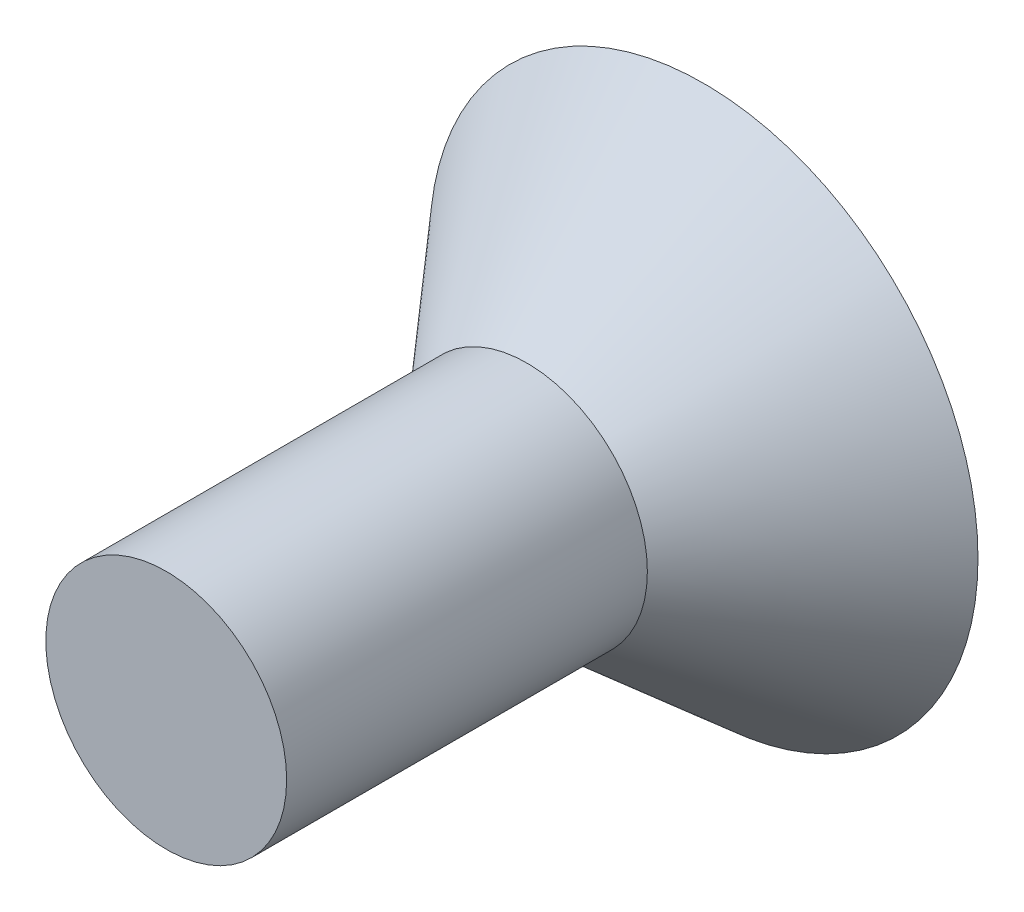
from build123d import *

# Parameters (mm, degrees)
HEX_2_DEPTH = 1.778


with BuildPart() as part:
    # Sketch6 → Revolve1 (revolve)
    with BuildSketch(Plane(origin=(0, 0, 0), x_dir=(0, 0, -1), z_dir=(1, 0, 0)), mode=Mode.PRIVATE) as revolve1_sk:
        Polygon((-6.35, 0), (-6.35, -1.4224), (-2.089184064, -1.4224), (0, -3.2385), (0, 0), align=None)
    revolve(revolve1_sk.sketch.rotate(Axis((0, 0, 6.35), (0, 0, -1)), 270), axis=Axis((0, 0, 6.35), (0, 0, -1)))

    # Sketch7 → HEX 2 (cut)
    with BuildSketch(Plane(origin=(0, 0, 0), x_dir=(-1, 0, 0), z_dir=(0, 0, -1))):
        Polygon((-0.8001, 0.46193795), (-0.8001, -0.46193795), (0, -0.923875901), (0.8001, -0.46193795), (0.8001, 0.46193795), (0, 0.923875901), align=None)
    extrude(amount=-HEX_2_DEPTH, mode=Mode.SUBTRACT)


solid = part.part
